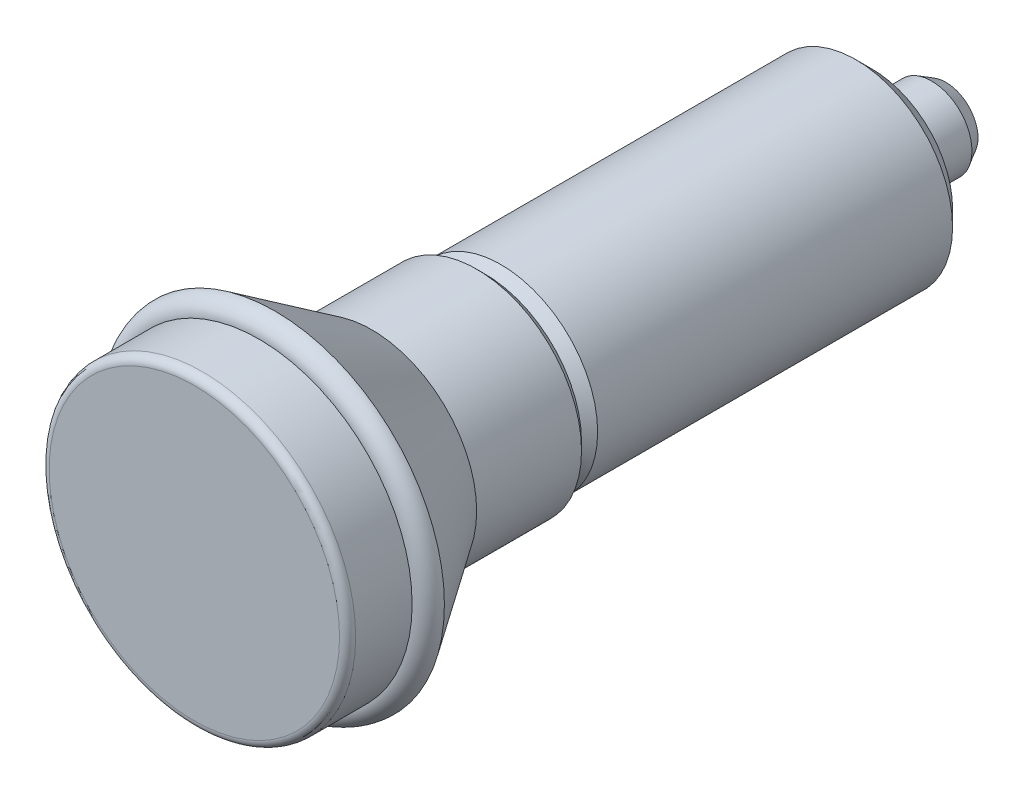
ISO-10303-21;
HEADER;
FILE_DESCRIPTION(('STEP AP214'),'2;1');
FILE_NAME('part.step','',(''),(''),'','','');
FILE_SCHEMA(('AUTOMOTIVE_DESIGN { 1 0 10303 214 1 1 1 1 }'));
ENDSEC;
DATA;
#1=APPLICATION_CONTEXT('core data for automotive mechanical design processes');
#2=APPLICATION_PROTOCOL_DEFINITION('international standard','automotive_design',2000,#1);
#3=PRODUCT_CONTEXT('',#1,'mechanical');
#4=PRODUCT('Part','Part','',(#3));
#5=PRODUCT_RELATED_PRODUCT_CATEGORY('part','',(#4));
#6=PRODUCT_DEFINITION_FORMATION('','',#4);
#7=PRODUCT_DEFINITION_CONTEXT('part definition',#1,'design');
#8=PRODUCT_DEFINITION('design','',#6,#7);
#9=PRODUCT_DEFINITION_SHAPE('','',#8);
#10=(LENGTH_UNIT() NAMED_UNIT(*) SI_UNIT(.MILLI.,.METRE.));
#11=(NAMED_UNIT(*) PLANE_ANGLE_UNIT() SI_UNIT($,.RADIAN.));
#12=(NAMED_UNIT(*) SI_UNIT($,.STERADIAN.) SOLID_ANGLE_UNIT());
#13=UNCERTAINTY_MEASURE_WITH_UNIT(LENGTH_MEASURE(1.E-05),#10,'distance_accuracy_value','');
#14=(GEOMETRIC_REPRESENTATION_CONTEXT(3) GLOBAL_UNCERTAINTY_ASSIGNED_CONTEXT((#13)) GLOBAL_UNIT_ASSIGNED_CONTEXT((#10,
#11,#12)) REPRESENTATION_CONTEXT('',''));
#15=CARTESIAN_POINT('',(0.,0.,0.));
#16=DIRECTION('',(0.,0.,1.));
#17=DIRECTION('',(1.,0.,0.));
#18=AXIS2_PLACEMENT_3D('',#15,#16,#17);
#19=CARTESIAN_POINT('',(0.,0.,0.));
#20=DIRECTION('',(0.,0.,1.));
#21=DIRECTION('',(0.,1.,0.));
#22=AXIS2_PLACEMENT_3D('',#19,#20,#21);
#23=SPHERICAL_SURFACE('',#22,4.99999999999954);
#24=CARTESIAN_POINT('',(0.,0.,-4.58812253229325));
#25=DIRECTION('',(0.,0.,1.));
#26=DIRECTION('',(1.,0.,0.));
#27=AXIS2_PLACEMENT_3D('',#24,#25,#26);
#28=CIRCLE('',#27,1.98724221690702);
#29=CARTESIAN_POINT('',(1.98724221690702,0.,-4.58812253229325));
#30=VERTEX_POINT('',#29);
#31=EDGE_CURVE('E58',#30,#30,#28,.T.);
#32=ORIENTED_EDGE('',*,*,#31,.F.);
#33=EDGE_LOOP('',(#32));
#34=FACE_BOUND('',#33,.T.);
#35=ADVANCED_FACE('F12',(#34),#23,.T.);
#36=CARTESIAN_POINT('',(0.,9.00000426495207,41.9999999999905));
#37=DIRECTION('',(0.,0.,1.));
#38=DIRECTION('',(1.,0.,0.));
#39=AXIS2_PLACEMENT_3D('',#36,#37,#38);
#40=PLANE('',#39);
#41=CARTESIAN_POINT('',(0.,0.,41.9999999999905));
#42=DIRECTION('',(0.,0.,1.));
#43=DIRECTION('',(1.,0.,0.));
#44=AXIS2_PLACEMENT_3D('',#41,#42,#43);
#45=CIRCLE('',#44,9.00000426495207);
#46=CARTESIAN_POINT('',(9.00000426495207,0.,41.9999999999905));
#47=VERTEX_POINT('',#46);
#48=EDGE_CURVE('E8',#47,#47,#45,.T.);
#49=ORIENTED_EDGE('',*,*,#48,.T.);
#50=EDGE_LOOP('',(#49));
#51=FACE_BOUND('',#50,.T.);
#52=ADVANCED_FACE('F66',(#51),#40,.T.);
#53=CARTESIAN_POINT('',(0.,0.,41.5));
#54=DIRECTION('',(0.,0.,1.));
#55=DIRECTION('',(1.,0.,0.));
#56=AXIS2_PLACEMENT_3D('',#53,#54,#55);
#57=TOROIDAL_SURFACE('',#56,8.99999999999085,0.500000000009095);
#58=CARTESIAN_POINT('',(0.,0.,41.4999999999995));
#59=DIRECTION('',(0.,0.,1.));
#60=DIRECTION('',(1.,0.,0.));
#61=AXIS2_PLACEMENT_3D('',#58,#59,#60);
#62=CIRCLE('',#61,9.5);
#63=CARTESIAN_POINT('',(9.5,0.,41.4999999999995));
#64=VERTEX_POINT('',#63);
#65=EDGE_CURVE('E18',#64,#64,#62,.T.);
#66=ORIENTED_EDGE('',*,*,#65,.T.);
#67=EDGE_LOOP('',(#66));
#68=FACE_BOUND('',#67,.T.);
#69=ORIENTED_EDGE('',*,*,#48,.F.);
#70=EDGE_LOOP('',(#69));
#71=FACE_BOUND('',#70,.T.);
#72=ADVANCED_FACE('F71',(#68,#71),#57,.T.);
#73=CARTESIAN_POINT('',(0.,0.,41.9999999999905));
#74=DIRECTION('',(0.,0.,1.));
#75=DIRECTION('',(1.,0.,0.));
#76=AXIS2_PLACEMENT_3D('',#73,#74,#75);
#77=CYLINDRICAL_SURFACE('',#76,9.5);
#78=CARTESIAN_POINT('',(0.,0.,37.9999999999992));
#79=DIRECTION('',(0.,0.,1.));
#80=DIRECTION('',(1.,0.,0.));
#81=AXIS2_PLACEMENT_3D('',#78,#79,#80);
#82=CIRCLE('',#81,9.5);
#83=CARTESIAN_POINT('',(9.5,0.,37.9999999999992));
#84=VERTEX_POINT('',#83);
#85=EDGE_CURVE('E22',#84,#84,#82,.T.);
#86=ORIENTED_EDGE('',*,*,#85,.T.);
#87=EDGE_LOOP('',(#86));
#88=FACE_BOUND('',#87,.T.);
#89=ORIENTED_EDGE('',*,*,#65,.F.);
#90=EDGE_LOOP('',(#89));
#91=FACE_BOUND('',#90,.T.);
#92=ADVANCED_FACE('F75',(#88,#91),#77,.T.);
#93=CARTESIAN_POINT('',(0.,0.,37.000000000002));
#94=DIRECTION('',(0.,0.,1.));
#95=DIRECTION('',(1.,0.,0.));
#96=AXIS2_PLACEMENT_3D('',#93,#94,#95);
#97=TOROIDAL_SURFACE('',#96,9.49999999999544,0.999999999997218);
#98=CARTESIAN_POINT('',(0.,0.,37.));
#99=DIRECTION('',(0.,0.,1.));
#100=DIRECTION('',(1.,0.,0.));
#101=AXIS2_PLACEMENT_3D('',#98,#99,#100);
#102=CIRCLE('',#101,10.4999999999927);
#103=CARTESIAN_POINT('',(10.4999999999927,0.,37.));
#104=VERTEX_POINT('',#103);
#105=EDGE_CURVE('E26',#104,#104,#102,.T.);
#106=ORIENTED_EDGE('',*,*,#105,.T.);
#107=EDGE_LOOP('',(#106));
#108=FACE_BOUND('',#107,.T.);
#109=ORIENTED_EDGE('',*,*,#85,.F.);
#110=EDGE_LOOP('',(#109));
#111=FACE_BOUND('',#110,.T.);
#112=ADVANCED_FACE('F80',(#108,#111),#97,.T.);
#113=CARTESIAN_POINT('',(0.,0.,37.));
#114=DIRECTION('',(0.,0.,1.));
#115=DIRECTION('',(1.,0.,0.));
#116=AXIS2_PLACEMENT_3D('',#113,#114,#115);
#117=CONICAL_SURFACE('',#116,10.4999999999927,0.588002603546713);
#118=CARTESIAN_POINT('',(0.,0.,31.));
#119=DIRECTION('',(0.,0.,1.));
#120=DIRECTION('',(1.,0.,0.));
#121=AXIS2_PLACEMENT_3D('',#118,#119,#120);
#122=CIRCLE('',#121,6.5);
#123=CARTESIAN_POINT('',(6.5,0.,31.));
#124=VERTEX_POINT('',#123);
#125=EDGE_CURVE('E31',#124,#124,#122,.T.);
#126=ORIENTED_EDGE('',*,*,#125,.T.);
#127=EDGE_LOOP('',(#126));
#128=FACE_BOUND('',#127,.T.);
#129=ORIENTED_EDGE('',*,*,#105,.F.);
#130=EDGE_LOOP('',(#129));
#131=FACE_BOUND('',#130,.T.);
#132=ADVANCED_FACE('F84',(#128,#131),#117,.T.);
#133=CARTESIAN_POINT('',(0.,0.,41.9999999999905));
#134=DIRECTION('',(0.,0.,1.));
#135=DIRECTION('',(1.,0.,0.));
#136=AXIS2_PLACEMENT_3D('',#133,#134,#135);
#137=CYLINDRICAL_SURFACE('',#136,6.5);
#138=CARTESIAN_POINT('',(0.,0.,24.5));
#139=DIRECTION('',(0.,0.,1.));
#140=DIRECTION('',(1.,0.,0.));
#141=AXIS2_PLACEMENT_3D('',#138,#139,#140);
#142=CIRCLE('',#141,6.5);
#143=CARTESIAN_POINT('',(6.5,0.,24.5));
#144=VERTEX_POINT('',#143);
#145=EDGE_CURVE('E34',#144,#144,#142,.T.);
#146=ORIENTED_EDGE('',*,*,#145,.T.);
#147=EDGE_LOOP('',(#146));
#148=FACE_BOUND('',#147,.T.);
#149=ORIENTED_EDGE('',*,*,#125,.F.);
#150=EDGE_LOOP('',(#149));
#151=FACE_BOUND('',#150,.T.);
#152=ADVANCED_FACE('F88',(#148,#151),#137,.T.);
#153=CARTESIAN_POINT('',(0.,0.,24.5));
#154=DIRECTION('',(0.,0.,1.));
#155=DIRECTION('',(1.,0.,0.));
#156=AXIS2_PLACEMENT_3D('',#153,#154,#155);
#157=CONICAL_SURFACE('',#156,6.5,0.785398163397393);
#158=CARTESIAN_POINT('',(0.,0.,24.));
#159=DIRECTION('',(0.,0.,1.));
#160=DIRECTION('',(1.,0.,0.));
#161=AXIS2_PLACEMENT_3D('',#158,#159,#160);
#162=CIRCLE('',#161,6.);
#163=CARTESIAN_POINT('',(6.,0.,24.));
#164=VERTEX_POINT('',#163);
#165=EDGE_CURVE('E37',#164,#164,#162,.T.);
#166=ORIENTED_EDGE('',*,*,#165,.T.);
#167=EDGE_LOOP('',(#166));
#168=FACE_BOUND('',#167,.T.);
#169=ORIENTED_EDGE('',*,*,#145,.F.);
#170=EDGE_LOOP('',(#169));
#171=FACE_BOUND('',#170,.T.);
#172=ADVANCED_FACE('F92',(#168,#171),#157,.T.);
#173=CARTESIAN_POINT('',(0.,6.,24.));
#174=DIRECTION('',(0.,0.,-1.));
#175=DIRECTION('',(-1.,0.,0.));
#176=AXIS2_PLACEMENT_3D('',#173,#174,#175);
#177=PLANE('',#176);
#178=CARTESIAN_POINT('',(0.,0.,24.));
#179=DIRECTION('',(0.,0.,1.));
#180=DIRECTION('',(1.,0.,0.));
#181=AXIS2_PLACEMENT_3D('',#178,#179,#180);
#182=CIRCLE('',#181,5.);
#183=CARTESIAN_POINT('',(5.,0.,24.));
#184=VERTEX_POINT('',#183);
#185=EDGE_CURVE('E40',#184,#184,#182,.T.);
#186=ORIENTED_EDGE('',*,*,#185,.T.);
#187=EDGE_LOOP('',(#186));
#188=FACE_BOUND('',#187,.T.);
#189=ORIENTED_EDGE('',*,*,#165,.F.);
#190=EDGE_LOOP('',(#189));
#191=FACE_BOUND('',#190,.T.);
#192=ADVANCED_FACE('F96',(#188,#191),#177,.T.);
#193=CARTESIAN_POINT('',(0.,0.,24.));
#194=DIRECTION('',(0.,0.,-1.));
#195=DIRECTION('',(-1.,0.,0.));
#196=AXIS2_PLACEMENT_3D('',#193,#194,#195);
#197=CONICAL_SURFACE('',#196,5.,0.785398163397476);
#198=CARTESIAN_POINT('',(0.,0.,23.));
#199=DIRECTION('',(0.,0.,1.));
#200=DIRECTION('',(1.,0.,0.));
#201=AXIS2_PLACEMENT_3D('',#198,#199,#200);
#202=CIRCLE('',#201,6.);
#203=CARTESIAN_POINT('',(6.,0.,23.));
#204=VERTEX_POINT('',#203);
#205=EDGE_CURVE('E43',#204,#204,#202,.T.);
#206=ORIENTED_EDGE('',*,*,#205,.T.);
#207=EDGE_LOOP('',(#206));
#208=FACE_BOUND('',#207,.T.);
#209=ORIENTED_EDGE('',*,*,#185,.F.);
#210=EDGE_LOOP('',(#209));
#211=FACE_BOUND('',#210,.T.);
#212=ADVANCED_FACE('F100',(#208,#211),#197,.T.);
#213=CARTESIAN_POINT('',(0.,0.,41.9999999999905));
#214=DIRECTION('',(0.,0.,1.));
#215=DIRECTION('',(1.,0.,0.));
#216=AXIS2_PLACEMENT_3D('',#213,#214,#215);
#217=CYLINDRICAL_SURFACE('',#216,6.);
#218=CARTESIAN_POINT('',(0.,0.,1.));
#219=DIRECTION('',(0.,0.,1.));
#220=DIRECTION('',(1.,0.,0.));
#221=AXIS2_PLACEMENT_3D('',#218,#219,#220);
#222=CIRCLE('',#221,6.);
#223=CARTESIAN_POINT('',(6.,0.,1.));
#224=VERTEX_POINT('',#223);
#225=EDGE_CURVE('E46',#224,#224,#222,.T.);
#226=ORIENTED_EDGE('',*,*,#225,.T.);
#227=EDGE_LOOP('',(#226));
#228=FACE_BOUND('',#227,.T.);
#229=ORIENTED_EDGE('',*,*,#205,.F.);
#230=EDGE_LOOP('',(#229));
#231=FACE_BOUND('',#230,.T.);
#232=ADVANCED_FACE('F104',(#228,#231),#217,.T.);
#233=CARTESIAN_POINT('',(0.,0.,1.));
#234=DIRECTION('',(0.,0.,1.));
#235=DIRECTION('',(1.,0.,0.));
#236=AXIS2_PLACEMENT_3D('',#233,#234,#235);
#237=CONICAL_SURFACE('',#236,6.,0.785398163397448);
#238=CARTESIAN_POINT('',(0.,0.,0.));
#239=DIRECTION('',(0.,0.,1.));
#240=DIRECTION('',(1.,0.,0.));
#241=AXIS2_PLACEMENT_3D('',#238,#239,#240);
#242=CIRCLE('',#241,5.);
#243=CARTESIAN_POINT('',(5.,0.,0.));
#244=VERTEX_POINT('',#243);
#245=EDGE_CURVE('E49',#244,#244,#242,.T.);
#246=ORIENTED_EDGE('',*,*,#245,.T.);
#247=EDGE_LOOP('',(#246));
#248=FACE_BOUND('',#247,.T.);
#249=ORIENTED_EDGE('',*,*,#225,.F.);
#250=EDGE_LOOP('',(#249));
#251=FACE_BOUND('',#250,.T.);
#252=ADVANCED_FACE('F108',(#248,#251),#237,.T.);
#253=CARTESIAN_POINT('',(0.,5.,0.));
#254=DIRECTION('',(0.,0.,-1.));
#255=DIRECTION('',(-1.,0.,0.));
#256=AXIS2_PLACEMENT_3D('',#253,#254,#255);
#257=PLANE('',#256);
#258=CARTESIAN_POINT('',(0.,0.,0.));
#259=DIRECTION('',(0.,0.,1.));
#260=DIRECTION('',(1.,0.,0.));
#261=AXIS2_PLACEMENT_3D('',#258,#259,#260);
#262=CIRCLE('',#261,2.5);
#263=CARTESIAN_POINT('',(2.5,0.,0.));
#264=VERTEX_POINT('',#263);
#265=EDGE_CURVE('E52',#264,#264,#262,.T.);
#266=ORIENTED_EDGE('',*,*,#265,.T.);
#267=EDGE_LOOP('',(#266));
#268=FACE_BOUND('',#267,.T.);
#269=ORIENTED_EDGE('',*,*,#245,.F.);
#270=EDGE_LOOP('',(#269));
#271=FACE_BOUND('',#270,.T.);
#272=ADVANCED_FACE('F112',(#268,#271),#257,.T.);
#273=CARTESIAN_POINT('',(0.,0.,41.9999999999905));
#274=DIRECTION('',(0.,0.,1.));
#275=DIRECTION('',(1.,0.,0.));
#276=AXIS2_PLACEMENT_3D('',#273,#274,#275);
#277=CYLINDRICAL_SURFACE('',#276,2.5);
#278=CARTESIAN_POINT('',(0.,0.,-3.69999999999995));
#279=DIRECTION('',(0.,0.,1.));
#280=DIRECTION('',(1.,0.,0.));
#281=AXIS2_PLACEMENT_3D('',#278,#279,#280);
#282=CIRCLE('',#281,2.5);
#283=CARTESIAN_POINT('',(2.5,0.,-3.69999999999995));
#284=VERTEX_POINT('',#283);
#285=EDGE_CURVE('E55',#284,#284,#282,.T.);
#286=ORIENTED_EDGE('',*,*,#285,.T.);
#287=EDGE_LOOP('',(#286));
#288=FACE_BOUND('',#287,.T.);
#289=ORIENTED_EDGE('',*,*,#265,.F.);
#290=EDGE_LOOP('',(#289));
#291=FACE_BOUND('',#290,.T.);
#292=ADVANCED_FACE('F116',(#288,#291),#277,.T.);
#293=CARTESIAN_POINT('',(0.,0.,-3.69999999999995));
#294=DIRECTION('',(0.,0.,1.));
#295=DIRECTION('',(1.,0.,0.));
#296=AXIS2_PLACEMENT_3D('',#293,#294,#295);
#297=CONICAL_SURFACE('',#296,2.5,0.523598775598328);
#298=ORIENTED_EDGE('',*,*,#31,.T.);
#299=EDGE_LOOP('',(#298));
#300=FACE_BOUND('',#299,.T.);
#301=ORIENTED_EDGE('',*,*,#285,.F.);
#302=EDGE_LOOP('',(#301));
#303=FACE_BOUND('',#302,.T.);
#304=ADVANCED_FACE('F62',(#300,#303),#297,.T.);
#305=CLOSED_SHELL('',(#35,#52,#72,#92,#112,#132,#152,#172,#192,#212,#232,#252,#272,#292,#304));
#306=MANIFOLD_SOLID_BREP('B1',#305);
#307=ADVANCED_BREP_SHAPE_REPRESENTATION('',(#18,#306),#14);
#308=SHAPE_DEFINITION_REPRESENTATION(#9,#307);
ENDSEC;
END-ISO-10303-21;
